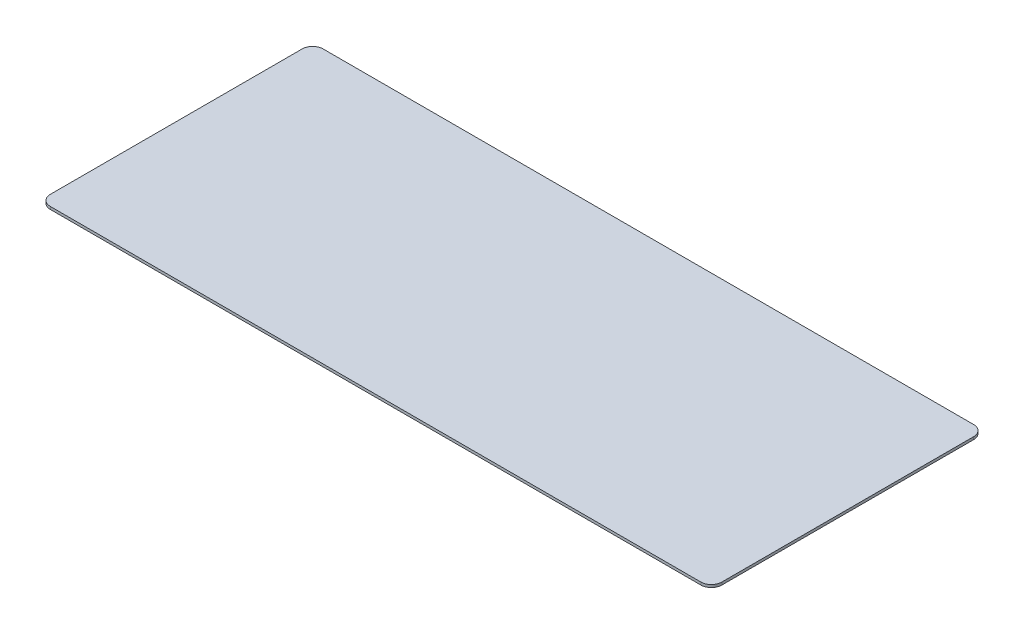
from build123d import *

# Parameters (mm, degrees)
SKETCH1_W           = 1625.6
SKETCH1_H           = 660.4
BOSS_EXTRUDE1_DEPTH = 6.35
FILLET1_R           = 25.4


with BuildPart() as part:
    # Sketch1 → Boss-Extrude1 (new body)
    with BuildSketch(Plane(origin=(0, 0, 0), x_dir=(1, 0, 0), z_dir=(0, 1, 0))):
        Rectangle(SKETCH1_W, SKETCH1_H)
    extrude(amount=BOSS_EXTRUDE1_DEPTH)

    # Fillet1
    fillet1_edges = [part.edges().sort_by_distance(p)[0] for p in [
        (-812.8, 3.175, -330.2),
        (812.8, 3.175, -330.2),
        (812.8, 3.175, 330.2),
        (-812.8, 3.175, 330.2),
    ]]
    fillet(fillet1_edges, radius=FILLET1_R)


solid = part.part
